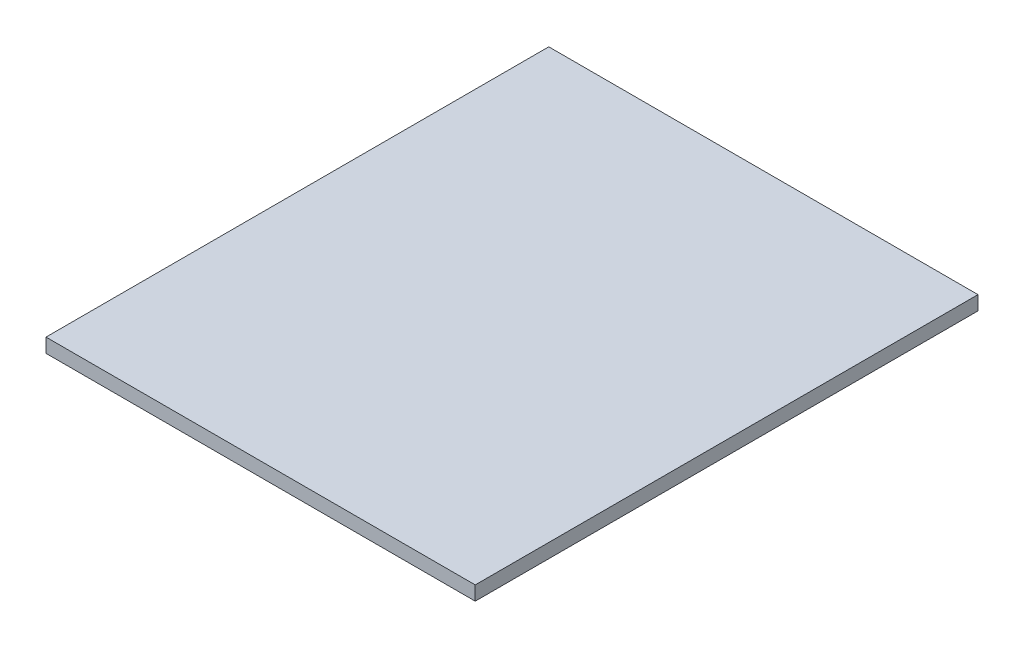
from build123d import *

# Parameters (mm, degrees)
SKETCH2_W           = 76
SKETCH2_H           = 89.02
BOSS_EXTRUDE1_DEPTH = 2.5


with BuildPart() as part:
    # Sketch2 → Boss-Extrude1 (new body)
    with BuildSketch(Plane(origin=(0, 0, 0), x_dir=(1, 0, 0), z_dir=(0, 1, 0))):
        with Locations((-28.506690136, 15.49)):
            Rectangle(SKETCH2_W, SKETCH2_H)
    extrude(amount=BOSS_EXTRUDE1_DEPTH)


solid = part.part
